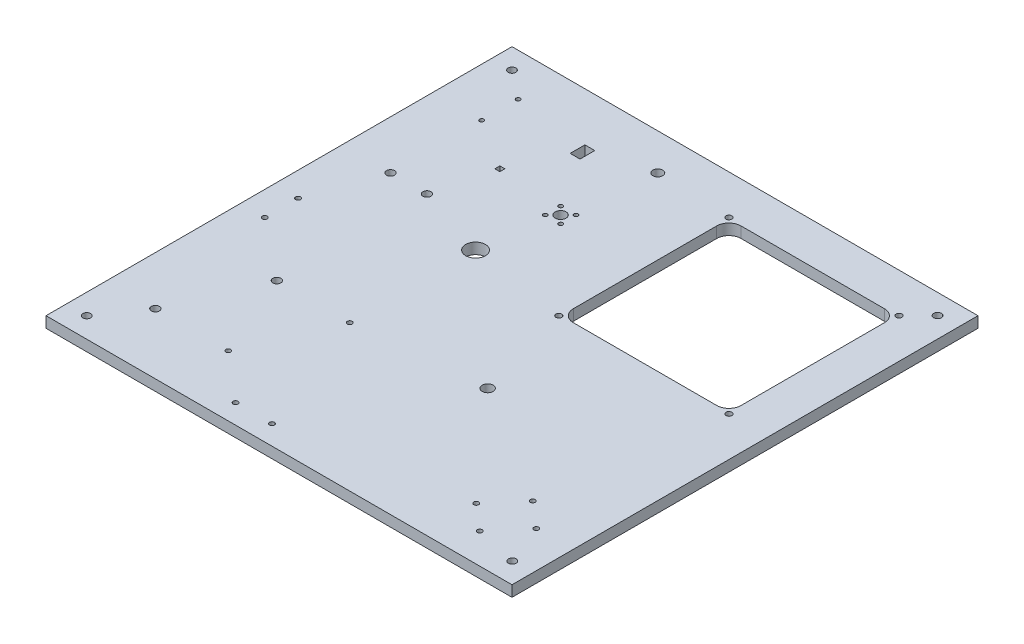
from build123d import *

# Parameters (mm, degrees)
SKETCH2_W                  = 383.54
SKETCH2_H                  = 383.54
BOSS_EXTRUDE2_DEPTH        = 8.9916
M6_CLEARANCE_HOLE3_D       = 6.6
M8_CLEARANCE_HOLE2_D       = 10
F_1_4_0_2500_DOWEL_HOLE1_D = 6.35
F_4_0MM_DOWEL_HOLE1_D      = 4
F_4_0MM_DOWEL_HOLE1_DEPTH  = 8.99
F_4_0MM_DOWEL_HOLE1_TIP    = 1.201721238
M6_CLEARANCE_HOLE2_D       = 6.6
M6_CLEARANCE_HOLE2_DEPTH   = 8.99
M6_CLEARANCE_HOLE2_TIP     = 1.982840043
M8_CLEARANCE_HOLE1_D       = 9
M8_CLEARANCE_HOLE1_DEPTH   = 8.99
M8_CLEARANCE_HOLE1_TIP     = 2.703872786
M3_CLEARANCE_HOLE1_D       = 3.4
M3_CLEARANCE_HOLE1_DEPTH   = 8.99
M3_CLEARANCE_HOLE1_TIP     = 1.021463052
SKETCH19_R                 = 8.1
SKETCH19_R_2               = 4.06
SKETCH19_R_3               = 4.5
SKETCH19_W                 = 8.12
SKETCH19_H                 = 12.14
SKETCH19_W_2               = 4.12
SKETCH19_H_2               = 4.12
CUT_EXTRUDE1_DEPTH         = 272.352749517
M4_CLEARANCE_HOLE1_D       = 4.8
CUT_EXTRUDE2_DEPTH         = 272.352749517


with BuildPart() as part:
    # Sketch2 → Boss-Extrude2 (new body)
    with BuildSketch(Plane(origin=(0, 0, 0), x_dir=(1, 0, 0), z_dir=(0, 1, 0))):
        Rectangle(SKETCH2_W, SKETCH2_H)
    extrude(amount=BOSS_EXTRUDE2_DEPTH)

    # M6 Clearance Hole3 (through all)
    with Locations(Plane(origin=(0, 8.9916, 0), x_dir=(1, 0, 0), z_dir=(0, 1, 0))):
        with Locations((51.77, 151.77), (151.77, 151.77), (101.77, 101.77), (51.77, 51.77), (76.77, 76.77), (101.77, 51.77)):
            Hole(M6_CLEARANCE_HOLE3_D / 2)

    # M8 Clearance Hole2 (through all)
    with Locations(Plane(origin=(0, 8.9916, 0), x_dir=(1, 0, 0), z_dir=(0, 1, 0))):
        with Locations((126.77, 126.77), (26.77, 126.77), (151.77, 101.77), (126.77, 26.77), (76.77, 26.77), (26.77, 76.77)):
            Hole(M8_CLEARANCE_HOLE2_D / 2)

    # 1_4 _0.2500_ Dowel Hole1 (through all)
    with Locations(Plane(origin=(0, 8.9916, 0), x_dir=(1, 0, 0), z_dir=(0, 1, 0))):
        with Locations((-175, -175), (-175, 175), (175, 175.23), (175, -174.77)):
            Hole(F_1_4_0_2500_DOWEL_HOLE1_D / 2)

    # 4.0mm Dowel Hole1
    with Locations(Plane(origin=(0, 8.9916, 0), x_dir=(1, 0, 0), z_dir=(0, 1, 0))):
        with Locations((-51.77, -175.77), (-21.77, -175.77), (-91.77, -141.77), (-61.77, -71.77), (-171.77, -31.77), (-171.77, -4.338), (140.229340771, -166.77), (161.77, -141.77), (140.577784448, -123.47), (119.03712522, -148.47)):
            Hole(F_4_0MM_DOWEL_HOLE1_D / 2, depth=F_4_0MM_DOWEL_HOLE1_DEPTH)
            with Locations((0, 0, -(F_4_0MM_DOWEL_HOLE1_DEPTH + F_4_0MM_DOWEL_HOLE1_TIP / 2))):  # 118° drill point
                Cone(0, F_4_0MM_DOWEL_HOLE1_D / 2, F_4_0MM_DOWEL_HOLE1_TIP, mode=Mode.SUBTRACT)

    # M6 Clearance Hole2
    with Locations(Plane(origin=(0, 8.9916, 0), x_dir=(1, 0, 0), z_dir=(0, 1, 0))):
        with Locations((-151.77, -141.77), (-121.77, -71.77), (-151.77, 51.77), (-121.77, 51.77)):
            Hole(M6_CLEARANCE_HOLE2_D / 2, depth=M6_CLEARANCE_HOLE2_DEPTH)
            with Locations((0, 0, -(M6_CLEARANCE_HOLE2_DEPTH + M6_CLEARANCE_HOLE2_TIP / 2))):  # 118° drill point
                Cone(0, M6_CLEARANCE_HOLE2_D / 2, M6_CLEARANCE_HOLE2_TIP, mode=Mode.SUBTRACT)

    # M8 Clearance Hole1
    with Locations(Plane(origin=(0, 8.9916, 0), x_dir=(1, 0, 0), z_dir=(0, 1, 0))):
        with Locations((41.77, -61.77)):
            Hole(M8_CLEARANCE_HOLE1_D / 2, depth=M8_CLEARANCE_HOLE1_DEPTH)
            with Locations((0, 0, -(M8_CLEARANCE_HOLE1_DEPTH + M8_CLEARANCE_HOLE1_TIP / 2))):  # 118° drill point
                Cone(0, M8_CLEARANCE_HOLE1_D / 2, M8_CLEARANCE_HOLE1_TIP, mode=Mode.SUBTRACT)

    # M3 Clearance Hole1
    with Locations(Plane(origin=(0, 8.9916, 0), x_dir=(1, 0, 0), z_dir=(0, 1, 0))):
        with Locations((-151.77, 156.77), (-151.77, 126.77), (-58.09, 85.44), (-45.44, 85.44), (-45.44, 98.09), (-58.09, 98.09)):
            Hole(M3_CLEARANCE_HOLE1_D / 2, depth=M3_CLEARANCE_HOLE1_DEPTH)
            with Locations((0, 0, -(M3_CLEARANCE_HOLE1_DEPTH + M3_CLEARANCE_HOLE1_TIP / 2))):  # 118° drill point
                Cone(0, M3_CLEARANCE_HOLE1_D / 2, M3_CLEARANCE_HOLE1_TIP, mode=Mode.SUBTRACT)

    # Sketch19 → Cut-Extrude1 (cut, through all)
    with BuildSketch(Plane(origin=(0, 8.9916, 0), x_dir=(1, 0, 0), z_dir=(0, 1, 0))):
        with Locations(Location((-61.77, 31.77, 0), (0, 0, 270))):
            Circle(SKETCH19_R)
        with Locations(Location((-41.77, 161.77, 0), (0, 0, 270))):
            Circle(SKETCH19_R_2)
        with Locations(Location((-51.77, 91.77, 0), (0, 0, 270))):
            Circle(SKETCH19_R_3)
        with Locations((-87.71, 145.7)):
            Rectangle(SKETCH19_W, SKETCH19_H)
        with Locations((-109.71, 99.71)):
            Rectangle(SKETCH19_W_2, SKETCH19_H_2)
    extrude(amount=-CUT_EXTRUDE1_DEPTH, mode=Mode.SUBTRACT)

    # M4 Clearance Hole1 (through all)
    with Locations(Plane(origin=(0, 8.9916, 0), x_dir=(1, 0, 0), z_dir=(0, 1, 0))):
        with Locations((159.27, 159.27), (19.27, 159.27), (19.27, 19.27), (159.27, 19.27)):
            Hole(M4_CLEARANCE_HOLE1_D / 2)

    # Sketch23 → Cut-Extrude2 (cut, through all)
    with BuildSketch(Plane(origin=(0, 8.9916, 0), x_dir=(1, 0, 0), z_dir=(0, 1, 0))):
        with BuildLine():
            Line((30.25, 20.25), (148.25, 20.25))
            ThreePointArc((148.25, 20.25), (155.321067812, 23.178932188), (158.25, 30.25))
            Line((158.25, 30.25), (158.25, 148.25))
            ThreePointArc((158.25, 148.25), (155.321067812, 155.321067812), (148.25, 158.25))
            Line((148.25, 158.25), (30.25, 158.25))
            ThreePointArc((30.25, 158.25), (23.178932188, 155.321067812), (20.25, 148.25))
            Line((20.25, 148.25), (20.25, 30.25))
            ThreePointArc((20.25, 30.25), (23.178932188, 23.178932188), (30.25, 20.25))
        make_face()
    extrude(amount=-CUT_EXTRUDE2_DEPTH, mode=Mode.SUBTRACT)


solid = part.part
